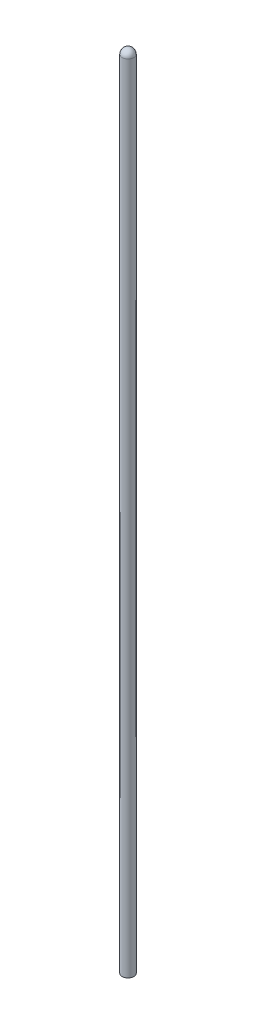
ISO-10303-21;
HEADER;
FILE_DESCRIPTION(('STEP AP214'),'2;1');
FILE_NAME('part.step','',(''),(''),'','','');
FILE_SCHEMA(('AUTOMOTIVE_DESIGN { 1 0 10303 214 1 1 1 1 }'));
ENDSEC;
DATA;
#1=APPLICATION_CONTEXT('core data for automotive mechanical design processes');
#2=APPLICATION_PROTOCOL_DEFINITION('international standard','automotive_design',2000,#1);
#3=PRODUCT_CONTEXT('',#1,'mechanical');
#4=PRODUCT('Part','Part','',(#3));
#5=PRODUCT_RELATED_PRODUCT_CATEGORY('part','',(#4));
#6=PRODUCT_DEFINITION_FORMATION('','',#4);
#7=PRODUCT_DEFINITION_CONTEXT('part definition',#1,'design');
#8=PRODUCT_DEFINITION('design','',#6,#7);
#9=PRODUCT_DEFINITION_SHAPE('','',#8);
#10=(LENGTH_UNIT() NAMED_UNIT(*) SI_UNIT(.MILLI.,.METRE.));
#11=(NAMED_UNIT(*) PLANE_ANGLE_UNIT() SI_UNIT($,.RADIAN.));
#12=(NAMED_UNIT(*) SI_UNIT($,.STERADIAN.) SOLID_ANGLE_UNIT());
#13=UNCERTAINTY_MEASURE_WITH_UNIT(LENGTH_MEASURE(1.E-05),#10,'distance_accuracy_value','');
#14=(GEOMETRIC_REPRESENTATION_CONTEXT(3) GLOBAL_UNCERTAINTY_ASSIGNED_CONTEXT((#13)) GLOBAL_UNIT_ASSIGNED_CONTEXT((#10,
#11,#12)) REPRESENTATION_CONTEXT('',''));
#15=CARTESIAN_POINT('',(0.,0.,0.));
#16=DIRECTION('',(0.,0.,1.));
#17=DIRECTION('',(1.,0.,0.));
#18=AXIS2_PLACEMENT_3D('',#15,#16,#17);
#19=CARTESIAN_POINT('',(0.,215.9,0.));
#20=DIRECTION('',(0.,-1.,0.));
#21=DIRECTION('',(0.,0.,-1.));
#22=AXIS2_PLACEMENT_3D('',#19,#20,#21);
#23=CYLINDRICAL_SURFACE('',#22,3.175);
#24=CARTESIAN_POINT('',(0.,215.9,0.));
#25=DIRECTION('',(0.,1.,0.));
#26=DIRECTION('',(0.,0.,1.));
#27=AXIS2_PLACEMENT_3D('',#24,#25,#26);
#28=CIRCLE('',#27,3.175);
#29=CARTESIAN_POINT('',(0.,215.9,3.175));
#30=VERTEX_POINT('',#29);
#31=EDGE_CURVE('E10',#30,#30,#28,.T.);
#32=ORIENTED_EDGE('',*,*,#31,.F.);
#33=EDGE_LOOP('',(#32));
#34=FACE_BOUND('',#33,.T.);
#35=CARTESIAN_POINT('',(0.,-215.9,0.));
#36=DIRECTION('',(0.,1.,0.));
#37=DIRECTION('',(0.,0.,1.));
#38=AXIS2_PLACEMENT_3D('',#35,#36,#37);
#39=CIRCLE('',#38,3.175);
#40=CARTESIAN_POINT('',(0.,-215.9,3.175));
#41=VERTEX_POINT('',#40);
#42=EDGE_CURVE('E359',#41,#41,#39,.T.);
#43=ORIENTED_EDGE('',*,*,#42,.T.);
#44=EDGE_LOOP('',(#43));
#45=FACE_BOUND('',#44,.T.);
#46=ADVANCED_FACE('F352',(#34,#45),#23,.T.);
#47=CARTESIAN_POINT('',(0.,215.9,0.));
#48=DIRECTION('',(0.,0.,1.));
#49=DIRECTION('',(1.,0.,0.));
#50=AXIS2_PLACEMENT_3D('',#47,#48,#49);
#51=SPHERICAL_SURFACE('',#50,3.175);
#52=CARTESIAN_POINT('',(0.,215.9,0.));
#53=DIRECTION('',(0.,1.,0.));
#54=DIRECTION('',(0.,0.,1.));
#55=AXIS2_PLACEMENT_3D('',#52,#53,#54);
#56=SPHERICAL_SURFACE('',#55,3.175);
#57=ORIENTED_EDGE('',*,*,#31,.T.);
#58=EDGE_LOOP('',(#57));
#59=FACE_BOUND('',#58,.T.);
#60=ADVANCED_FACE('F354',(#59),#56,.T.);
#61=CARTESIAN_POINT('',(0.,-215.9,0.));
#62=DIRECTION('',(0.,1.,0.));
#63=DIRECTION('',(0.,0.,1.));
#64=AXIS2_PLACEMENT_3D('',#61,#62,#63);
#65=PLANE('',#64);
#66=ORIENTED_EDGE('',*,*,#42,.F.);
#67=EDGE_LOOP('',(#66));
#68=FACE_BOUND('',#67,.T.);
#69=ADVANCED_FACE('F366',(#68),#65,.F.);
#70=CLOSED_SHELL('',(#46,#60,#69));
#71=MANIFOLD_SOLID_BREP('B2',#70);
#72=ADVANCED_BREP_SHAPE_REPRESENTATION('',(#18,#71),#14);
#73=SHAPE_DEFINITION_REPRESENTATION(#9,#72);
ENDSEC;
END-ISO-10303-21;
